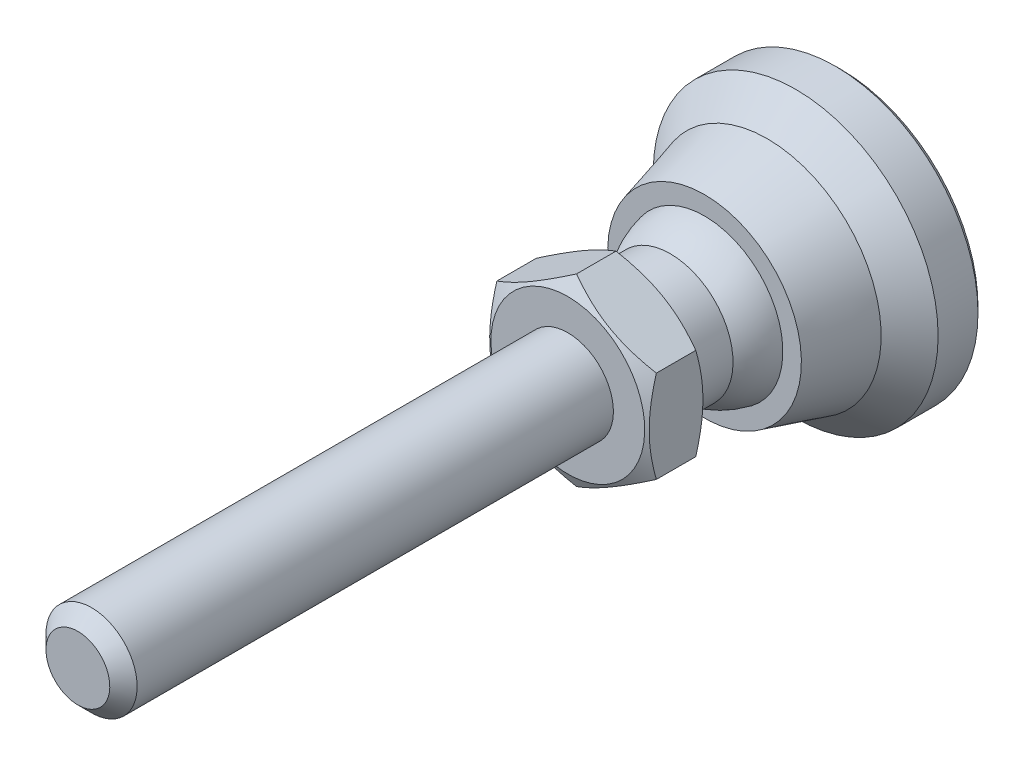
ISO-10303-21;
HEADER;
FILE_DESCRIPTION(('STEP AP214'),'2;1');
FILE_NAME('part.step','',(''),(''),'','','');
FILE_SCHEMA(('AUTOMOTIVE_DESIGN { 1 0 10303 214 1 1 1 1 }'));
ENDSEC;
DATA;
#1=APPLICATION_CONTEXT('core data for automotive mechanical design processes');
#2=APPLICATION_PROTOCOL_DEFINITION('international standard','automotive_design',2000,#1);
#3=PRODUCT_CONTEXT('',#1,'mechanical');
#4=PRODUCT('Part','Part','',(#3));
#5=PRODUCT_RELATED_PRODUCT_CATEGORY('part','',(#4));
#6=PRODUCT_DEFINITION_FORMATION('','',#4);
#7=PRODUCT_DEFINITION_CONTEXT('part definition',#1,'design');
#8=PRODUCT_DEFINITION('design','',#6,#7);
#9=PRODUCT_DEFINITION_SHAPE('','',#8);
#10=(LENGTH_UNIT() NAMED_UNIT(*) SI_UNIT(.MILLI.,.METRE.));
#11=(NAMED_UNIT(*) PLANE_ANGLE_UNIT() SI_UNIT($,.RADIAN.));
#12=(NAMED_UNIT(*) SI_UNIT($,.STERADIAN.) SOLID_ANGLE_UNIT());
#13=UNCERTAINTY_MEASURE_WITH_UNIT(LENGTH_MEASURE(1.E-05),#10,'distance_accuracy_value','');
#14=(GEOMETRIC_REPRESENTATION_CONTEXT(3) GLOBAL_UNCERTAINTY_ASSIGNED_CONTEXT((#13)) GLOBAL_UNIT_ASSIGNED_CONTEXT((#10,
#11,#12)) REPRESENTATION_CONTEXT('',''));
#15=CARTESIAN_POINT('',(0.,0.,0.));
#16=DIRECTION('',(0.,0.,1.));
#17=DIRECTION('',(1.,0.,0.));
#18=AXIS2_PLACEMENT_3D('',#15,#16,#17);
#19=CARTESIAN_POINT('',(-5.49999999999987,0.,19.));
#20=DIRECTION('',(0.,0.,1.));
#21=DIRECTION('',(0.,-1.,0.));
#22=AXIS2_PLACEMENT_3D('',#19,#20,#21);
#23=PLANE('',#22);
#24=CARTESIAN_POINT('',(0.,0.,19.));
#25=DIRECTION('',(0.,0.,-1.));
#26=DIRECTION('',(0.,1.,0.));
#27=AXIS2_PLACEMENT_3D('',#24,#25,#26);
#28=CIRCLE('',#27,5.49999999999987);
#29=CARTESIAN_POINT('',(0.,5.49999999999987,19.));
#30=VERTEX_POINT('',#29);
#31=EDGE_CURVE('E112',#30,#30,#28,.T.);
#32=ORIENTED_EDGE('',*,*,#31,.F.);
#33=EDGE_LOOP('',(#32));
#34=FACE_BOUND('',#33,.T.);
#35=CARTESIAN_POINT('',(0.,0.,19.));
#36=DIRECTION('',(0.,0.,-1.));
#37=DIRECTION('',(0.,1.,0.));
#38=AXIS2_PLACEMENT_3D('',#35,#36,#37);
#39=CIRCLE('',#38,6.75);
#40=CARTESIAN_POINT('',(0.,6.75,19.));
#41=VERTEX_POINT('',#40);
#42=EDGE_CURVE('E73',#41,#41,#39,.T.);
#43=ORIENTED_EDGE('',*,*,#42,.T.);
#44=EDGE_LOOP('',(#43));
#45=FACE_BOUND('',#44,.T.);
#46=ADVANCED_FACE('F14',(#34,#45),#23,.F.);
#47=CARTESIAN_POINT('',(0.,0.,0.5));
#48=DIRECTION('',(0.,0.,1.));
#49=DIRECTION('',(0.,-1.,0.));
#50=AXIS2_PLACEMENT_3D('',#47,#48,#49);
#51=CONICAL_SURFACE('',#50,12.5,0.785398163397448);
#52=CARTESIAN_POINT('',(0.,0.,0.));
#53=DIRECTION('',(0.,0.,-1.));
#54=DIRECTION('',(0.,1.,0.));
#55=AXIS2_PLACEMENT_3D('',#52,#53,#54);
#56=CIRCLE('',#55,12.);
#57=CARTESIAN_POINT('',(0.,12.,0.));
#58=VERTEX_POINT('',#57);
#59=EDGE_CURVE('E9',#58,#58,#56,.T.);
#60=ORIENTED_EDGE('',*,*,#59,.F.);
#61=EDGE_LOOP('',(#60));
#62=FACE_BOUND('',#61,.T.);
#63=CARTESIAN_POINT('',(0.,0.,0.5));
#64=DIRECTION('',(0.,0.,-1.));
#65=DIRECTION('',(0.,1.,0.));
#66=AXIS2_PLACEMENT_3D('',#63,#64,#65);
#67=CIRCLE('',#66,12.5);
#68=CARTESIAN_POINT('',(0.,12.5,0.5));
#69=VERTEX_POINT('',#68);
#70=EDGE_CURVE('E94',#69,#69,#67,.T.);
#71=ORIENTED_EDGE('',*,*,#70,.T.);
#72=EDGE_LOOP('',(#71));
#73=FACE_BOUND('',#72,.T.);
#74=ADVANCED_FACE('F16',(#62,#73),#51,.T.);
#75=CARTESIAN_POINT('',(-12.,0.,0.));
#76=DIRECTION('',(0.,0.,1.));
#77=DIRECTION('',(0.,-1.,0.));
#78=AXIS2_PLACEMENT_3D('',#75,#76,#77);
#79=PLANE('',#78);
#80=ORIENTED_EDGE('',*,*,#59,.T.);
#81=EDGE_LOOP('',(#80));
#82=FACE_BOUND('',#81,.T.);
#83=ADVANCED_FACE('F146',(#82),#79,.F.);
#84=CARTESIAN_POINT('',(0.,0.,0.));
#85=DIRECTION('',(0.,0.,-1.));
#86=DIRECTION('',(0.,1.,0.));
#87=AXIS2_PLACEMENT_3D('',#84,#85,#86);
#88=CYLINDRICAL_SURFACE('',#87,5.49999999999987);
#89=CARTESIAN_POINT('',(0.,0.,15.));
#90=DIRECTION('',(0.,0.,-1.));
#91=DIRECTION('',(0.,1.,0.));
#92=AXIS2_PLACEMENT_3D('',#89,#90,#91);
#93=CIRCLE('',#92,5.49999999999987);
#94=CARTESIAN_POINT('',(-5.49999999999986,0.,15.));
#95=VERTEX_POINT('',#94);
#96=EDGE_CURVE('E109',#95,#95,#93,.T.);
#97=ORIENTED_EDGE('',*,*,#96,.F.);
#98=EDGE_LOOP('',(#97));
#99=FACE_BOUND('',#98,.T.);
#100=ORIENTED_EDGE('',*,*,#31,.T.);
#101=EDGE_LOOP('',(#100));
#102=FACE_BOUND('',#101,.T.);
#103=ADVANCED_FACE('F152',(#99,#102),#88,.T.);
#104=CARTESIAN_POINT('',(1.38777878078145E-13,0.,10.6698729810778));
#105=DIRECTION('',(0.,0.,-1.));
#106=DIRECTION('',(-1.,0.,0.));
#107=AXIS2_PLACEMENT_3D('',#104,#105,#106);
#108=SPHERICAL_SURFACE('',#107,7.);
#109=CARTESIAN_POINT('',(0.,0.,12.));
#110=DIRECTION('',(0.,0.,-1.));
#111=DIRECTION('',(0.,1.,0.));
#112=AXIS2_PLACEMENT_3D('',#109,#110,#111);
#113=CIRCLE('',#112,6.87246404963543);
#114=CARTESIAN_POINT('',(-6.87246404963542,0.,12.));
#115=VERTEX_POINT('',#114);
#116=EDGE_CURVE('E106',#115,#115,#113,.T.);
#117=CARTESIAN_POINT('',(-6.87246404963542,0.,12.));
#118=CARTESIAN_POINT('',(-6.86587210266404,0.,12.0340591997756));
#119=CARTESIAN_POINT('',(-6.85902692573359,0.,12.0680693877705));
#120=CARTESIAN_POINT('',(-6.84483171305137,0.,12.1359842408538));
#121=CARTESIAN_POINT('',(-6.83748167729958,0.,12.1698889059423));
#122=CARTESIAN_POINT('',(-6.8222783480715,0.,12.2375852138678));
#123=CARTESIAN_POINT('',(-6.81442505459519,0.,12.2713768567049));
#124=CARTESIAN_POINT('',(-6.7982169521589,0.,12.3388396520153));
#125=CARTESIAN_POINT('',(-6.78986214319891,0.,12.3725108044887));
#126=CARTESIAN_POINT('',(-6.77265285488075,0.,12.4397251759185));
#127=CARTESIAN_POINT('',(-6.76379837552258,0.,12.473268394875));
#128=CARTESIAN_POINT('',(-6.74559170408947,0.,12.5402194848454));
#129=CARTESIAN_POINT('',(-6.73623951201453,0.,12.5736273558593));
#130=CARTESIAN_POINT('',(-6.71703948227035,0.,12.6403003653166));
#131=CARTESIAN_POINT('',(-6.70719164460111,0.,12.67356550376));
#132=CARTESIAN_POINT('',(-6.68700250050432,0.,12.7399456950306));
#133=CARTESIAN_POINT('',(-6.67666119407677,0.,12.7730607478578));
#134=CARTESIAN_POINT('',(-6.65548739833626,0.,12.8391334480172));
#135=CARTESIAN_POINT('',(-6.64465490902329,0.,12.8720910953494));
#136=CARTESIAN_POINT('',(-6.62250114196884,0.,12.9378416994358));
#137=CARTESIAN_POINT('',(-6.61117986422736,0.,12.9706346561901));
#138=CARTESIAN_POINT('',(-6.58805102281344,0.,13.0360486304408));
#139=CARTESIAN_POINT('',(-6.57624345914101,0.,13.0686696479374));
#140=CARTESIAN_POINT('',(-6.55214465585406,0.,13.1337325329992));
#141=CARTESIAN_POINT('',(-6.53985341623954,0.,13.1661744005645));
#142=CARTESIAN_POINT('',(-6.51478997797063,0.,13.2308718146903));
#143=CARTESIAN_POINT('',(-6.50201777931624,0.,13.2631273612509));
#144=CARTESIAN_POINT('',(-6.47599524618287,0.,13.3274450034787));
#145=CARTESIAN_POINT('',(-6.46274491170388,0.,13.3595070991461));
#146=CARTESIAN_POINT('',(-6.43576903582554,0.,13.4234307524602));
#147=CARTESIAN_POINT('',(-6.42204349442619,0.,13.455292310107));
#148=CARTESIAN_POINT('',(-6.39412023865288,0.,13.5188078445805));
#149=CARTESIAN_POINT('',(-6.37992252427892,0.,13.5504618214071));
#150=CARTESIAN_POINT('',(-6.35105806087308,0.,13.6135551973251));
#151=CARTESIAN_POINT('',(-6.33639131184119,0.,13.6449945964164));
#152=CARTESIAN_POINT('',(-6.30659202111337,0.,13.7076518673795));
#153=CARTESIAN_POINT('',(-6.29145947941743,0.,13.7388697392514));
#154=CARTESIAN_POINT('',(-6.26073194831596,0.,13.8010770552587));
#155=CARTESIAN_POINT('',(-6.24513695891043,0.,13.8320664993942));
#156=CARTESIAN_POINT('',(-6.21348797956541,0.,13.8938101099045));
#157=CARTESIAN_POINT('',(-6.19743398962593,0.,13.9245642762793));
#158=CARTESIAN_POINT('',(-6.16487055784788,0.,13.9858305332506));
#159=CARTESIAN_POINT('',(-6.14836111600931,0.,14.016342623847));
#160=CARTESIAN_POINT('',(-6.11489042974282,0.,14.0771179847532));
#161=CARTESIAN_POINT('',(-6.09792918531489,0.,14.107381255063));
#162=CARTESIAN_POINT('',(-6.06355864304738,0.,14.1676522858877));
#163=CARTESIAN_POINT('',(-6.04614934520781,0.,14.1976600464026));
#164=CARTESIAN_POINT('',(-6.01088654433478,0.,14.2574134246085));
#165=CARTESIAN_POINT('',(-5.99303304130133,0.,14.2871590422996));
#166=CARTESIAN_POINT('',(-5.95688577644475,0.,14.3463815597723));
#167=CARTESIAN_POINT('',(-5.93859201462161,0.,14.3758584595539));
#168=CARTESIAN_POINT('',(-5.90156827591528,0.,14.4345370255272));
#169=CARTESIAN_POINT('',(-5.88283829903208,0.,14.4637386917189));
#170=CARTESIAN_POINT('',(-5.84494627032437,0.,14.5218603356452));
#171=CARTESIAN_POINT('',(-5.82578421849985,0.,14.5507803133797));
#172=CARTESIAN_POINT('',(-5.78703227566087,0.,14.6083321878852));
#173=CARTESIAN_POINT('',(-5.76744238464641,0.,14.6369640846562));
#174=CARTESIAN_POINT('',(-5.72783909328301,0.,14.6939334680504));
#175=CARTESIAN_POINT('',(-5.70782569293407,0.,14.7222709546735));
#176=CARTESIAN_POINT('',(-5.66737980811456,0.,14.778645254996));
#177=CARTESIAN_POINT('',(-5.646947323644,0.,14.8066820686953));
#178=CARTESIAN_POINT('',(-5.60566778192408,0.,14.862448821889));
#179=CARTESIAN_POINT('',(-5.58482072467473,0.,14.8901787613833));
#180=CARTESIAN_POINT('',(-5.54271666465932,0.,14.9453256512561));
#181=CARTESIAN_POINT('',(-5.52145966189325,0.,14.9727426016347));
#182=CARTESIAN_POINT('',(-5.49999999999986,0.,15.));
#183=B_SPLINE_CURVE_WITH_KNOTS('',3,(#117,#118,#119,#120,#121,#122,#123,#124,#125,#126,#127,
#128,#129,#130,#131,#132,#133,#134,#135,#136,#137,#138,#139,#140,#141,#142,#143,#144,#145,#146,
#147,#148,#149,#150,#151,#152,#153,#154,#155,#156,#157,#158,#159,#160,#161,#162,#163,#164,#165,
#166,#167,#168,#169,#170,#171,#172,#173,#174,#175,#176,#177,#178,#179,#180,#181,#182),
.UNSPECIFIED.,.F.,.F.,(4,2,2,2,2,2,2,2,2,2,2,2,2,2,2,2,2,2,2,2,2,2,2,2,2,2,2,2,2,2,2,2,4),(0.,
0.104072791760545,0.208145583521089,0.312218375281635,0.416291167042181,0.520363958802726,
0.62443675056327,0.728509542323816,0.83258233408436,0.936655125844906,1.04072791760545,
1.144800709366,1.24887350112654,1.35294629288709,1.45701908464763,1.56109187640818,
1.66516466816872,1.76923745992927,1.87331025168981,1.97738304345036,2.0814558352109,
2.18552862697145,2.28960141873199,2.39367421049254,2.49774700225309,2.60181979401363,
2.70589258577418,2.80996537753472,2.91403816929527,3.01811096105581,3.12218375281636,
3.2262565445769,3.33032933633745),.UNSPECIFIED.);
#184=EDGE_CURVE('BSEAM248',#115,#95,#183,.T.);
#185=ORIENTED_EDGE('',*,*,#116,.F.);
#186=ORIENTED_EDGE('',*,*,#96,.T.);
#187=ORIENTED_EDGE('',*,*,#184,.T.);
#188=ORIENTED_EDGE('',*,*,#184,.F.);
#189=EDGE_LOOP('',(#185,#187,#186,#188));
#190=FACE_BOUND('',#189,.T.);
#191=ADVANCED_FACE('F248',(#190),#108,.T.);
#192=CARTESIAN_POINT('',(-8.5,0.,12.));
#193=DIRECTION('',(0.,0.,-1.));
#194=DIRECTION('',(0.,1.,0.));
#195=AXIS2_PLACEMENT_3D('',#192,#193,#194);
#196=PLANE('',#195);
#197=CARTESIAN_POINT('',(0.,0.,12.));
#198=DIRECTION('',(0.,0.,-1.));
#199=DIRECTION('',(0.,1.,0.));
#200=AXIS2_PLACEMENT_3D('',#197,#198,#199);
#201=CIRCLE('',#200,8.5);
#202=CARTESIAN_POINT('',(0.,8.5,12.));
#203=VERTEX_POINT('',#202);
#204=EDGE_CURVE('E103',#203,#203,#201,.T.);
#205=ORIENTED_EDGE('',*,*,#204,.F.);
#206=EDGE_LOOP('',(#205));
#207=FACE_BOUND('',#206,.T.);
#208=ORIENTED_EDGE('',*,*,#116,.T.);
#209=EDGE_LOOP('',(#208));
#210=FACE_BOUND('',#209,.T.);
#211=ADVANCED_FACE('F245',(#207,#210),#196,.F.);
#212=CARTESIAN_POINT('',(0.,0.,12.));
#213=DIRECTION('',(0.,0.,-1.));
#214=DIRECTION('',(0.,1.,0.));
#215=AXIS2_PLACEMENT_3D('',#212,#213,#214);
#216=CONICAL_SURFACE('',#215,8.5,0.266252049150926);
#217=CARTESIAN_POINT('',(0.,0.,6.5));
#218=DIRECTION('',(0.,0.,-1.));
#219=DIRECTION('',(0.,1.,0.));
#220=AXIS2_PLACEMENT_3D('',#217,#218,#219);
#221=CIRCLE('',#220,10.);
#222=CARTESIAN_POINT('',(0.,10.,6.5));
#223=VERTEX_POINT('',#222);
#224=EDGE_CURVE('E100',#223,#223,#221,.T.);
#225=ORIENTED_EDGE('',*,*,#224,.F.);
#226=EDGE_LOOP('',(#225));
#227=FACE_BOUND('',#226,.T.);
#228=ORIENTED_EDGE('',*,*,#204,.T.);
#229=EDGE_LOOP('',(#228));
#230=FACE_BOUND('',#229,.T.);
#231=ADVANCED_FACE('F241',(#227,#230),#216,.T.);
#232=CARTESIAN_POINT('',(0.,0.,6.5));
#233=DIRECTION('',(0.,0.,-1.));
#234=DIRECTION('',(0.,1.,0.));
#235=AXIS2_PLACEMENT_3D('',#232,#233,#234);
#236=CONICAL_SURFACE('',#235,10.,0.785398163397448);
#237=CARTESIAN_POINT('',(0.,0.,4.));
#238=DIRECTION('',(0.,0.,-1.));
#239=DIRECTION('',(0.,1.,0.));
#240=AXIS2_PLACEMENT_3D('',#237,#238,#239);
#241=CIRCLE('',#240,12.5);
#242=CARTESIAN_POINT('',(0.,12.5,4.));
#243=VERTEX_POINT('',#242);
#244=EDGE_CURVE('E97',#243,#243,#241,.T.);
#245=ORIENTED_EDGE('',*,*,#244,.F.);
#246=EDGE_LOOP('',(#245));
#247=FACE_BOUND('',#246,.T.);
#248=ORIENTED_EDGE('',*,*,#224,.T.);
#249=EDGE_LOOP('',(#248));
#250=FACE_BOUND('',#249,.T.);
#251=ADVANCED_FACE('F237',(#247,#250),#236,.T.);
#252=CARTESIAN_POINT('',(0.,0.,0.));
#253=DIRECTION('',(0.,0.,-1.));
#254=DIRECTION('',(0.,1.,0.));
#255=AXIS2_PLACEMENT_3D('',#252,#253,#254);
#256=CYLINDRICAL_SURFACE('',#255,12.5);
#257=ORIENTED_EDGE('',*,*,#70,.F.);
#258=EDGE_LOOP('',(#257));
#259=FACE_BOUND('',#258,.T.);
#260=ORIENTED_EDGE('',*,*,#244,.T.);
#261=EDGE_LOOP('',(#260));
#262=FACE_BOUND('',#261,.T.);
#263=ADVANCED_FACE('F137',(#259,#262),#256,.T.);
#264=CARTESIAN_POINT('',(0.,0.,19.));
#265=DIRECTION('',(0.,0.,1.));
#266=DIRECTION('',(0.,-1.,0.));
#267=AXIS2_PLACEMENT_3D('',#264,#265,#266);
#268=CONICAL_SURFACE('',#267,6.75,1.0471975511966);
#269=CARTESIAN_POINT('',(-7.,10.8907699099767,22.5774842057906));
#270=CARTESIAN_POINT('',(-7.,10.5847384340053,22.4288913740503));
#271=CARTESIAN_POINT('',(-7.,10.27800818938,22.2817132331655));
#272=CARTESIAN_POINT('',(-7.,9.66277868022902,21.9909812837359));
#273=CARTESIAN_POINT('',(-7.,9.3542791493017,21.8474280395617));
#274=CARTESIAN_POINT('',(-7.,8.73356682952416,21.5640260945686));
#275=CARTESIAN_POINT('',(-7.,8.42134299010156,21.4242015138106));
#276=CARTESIAN_POINT('',(-7.,7.79442424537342,21.150227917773));
#277=CARTESIAN_POINT('',(-7.,7.47972945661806,21.0160786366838));
#278=CARTESIAN_POINT('',(-7.,6.83707768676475,20.7507035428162));
#279=CARTESIAN_POINT('',(-7.,6.50902228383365,20.6197147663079));
#280=CARTESIAN_POINT('',(-7.,5.84908717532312,20.3675665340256));
#281=CARTESIAN_POINT('',(-7.,5.51720704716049,20.2464081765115));
#282=CARTESIAN_POINT('',(-7.,4.84970041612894,20.0170761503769));
#283=CARTESIAN_POINT('',(-7.,4.51408293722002,19.9088764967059));
#284=CARTESIAN_POINT('',(-7.,3.83804566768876,19.7089093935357));
#285=CARTESIAN_POINT('',(-7.,3.49762741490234,19.6171368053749));
#286=CARTESIAN_POINT('',(-7.,2.81363495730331,19.454900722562));
#287=CARTESIAN_POINT('',(-7.,2.47008922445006,19.3843204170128));
#288=CARTESIAN_POINT('',(-7.,1.95161396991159,19.2973818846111));
#289=CARTESIAN_POINT('',(-7.,1.77825011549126,19.2715565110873));
#290=CARTESIAN_POINT('',(-7.,1.43064965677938,19.2267222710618));
#291=CARTESIAN_POINT('',(-7.,1.25641314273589,19.2077127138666));
#292=CARTESIAN_POINT('',(-7.,0.909591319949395,19.1771288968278));
#293=CARTESIAN_POINT('',(-7.,0.737014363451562,19.1654603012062));
#294=CARTESIAN_POINT('',(-7.,0.391521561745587,19.1494333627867));
#295=CARTESIAN_POINT('',(-7.,0.218605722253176,19.1450748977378));
#296=CARTESIAN_POINT('',(-7.,-0.127255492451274,19.1437723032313));
#297=CARTESIAN_POINT('',(-7.,-0.300200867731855,19.1468281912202));
#298=CARTESIAN_POINT('',(-7.,-0.64580812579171,19.1602791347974));
#299=CARTESIAN_POINT('',(-7.,-0.818469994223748,19.1706745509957));
#300=CARTESIAN_POINT('',(-7.,-1.23236793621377,19.2041702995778));
#301=CARTESIAN_POINT('',(-7.,-1.47333290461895,19.2306940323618));
#302=CARTESIAN_POINT('',(-7.,-1.95348602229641,19.2965973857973));
#303=CARTESIAN_POINT('',(-7.,-2.19267392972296,19.3359787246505));
#304=CARTESIAN_POINT('',(-7.,-2.90729182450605,19.4713219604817));
#305=CARTESIAN_POINT('',(-7.,-3.37951267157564,19.5844589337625));
#306=CARTESIAN_POINT('',(-7.,-4.08566220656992,19.7808040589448));
#307=CARTESIAN_POINT('',(-7.,-4.32324940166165,19.8516126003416));
#308=CARTESIAN_POINT('',(-7.,-4.79611652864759,20.0006233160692));
#309=CARTESIAN_POINT('',(-7.,-5.03139644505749,20.0788255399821));
#310=CARTESIAN_POINT('',(-7.,-5.49972232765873,20.2413656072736));
#311=CARTESIAN_POINT('',(-7.,-5.73276899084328,20.3257014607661));
#312=CARTESIAN_POINT('',(-7.,-6.19692870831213,20.4995125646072));
#313=CARTESIAN_POINT('',(-7.,-6.42804178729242,20.5889877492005));
#314=CARTESIAN_POINT('',(-7.,-6.98148828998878,20.8092053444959));
#315=CARTESIAN_POINT('',(-7.,-7.30299231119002,20.9420285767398));
#316=CARTESIAN_POINT('',(-7.,-7.94319832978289,21.2142843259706));
#317=CARTESIAN_POINT('',(-7.,-8.26190014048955,21.3537172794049));
#318=CARTESIAN_POINT('',(-7.,-8.89703676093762,21.6378419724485));
#319=CARTESIAN_POINT('',(-7.,-9.21347100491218,21.7825349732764));
#320=CARTESIAN_POINT('',(-7.,-9.84438261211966,22.0760967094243));
#321=CARTESIAN_POINT('',(-7.,-10.1588600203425,22.224965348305));
#322=CARTESIAN_POINT('',(-7.,-10.7865516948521,22.5262551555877));
#323=CARTESIAN_POINT('',(-7.,-11.0997640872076,22.6786802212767));
#324=CARTESIAN_POINT('',(-7.,-11.7248247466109,22.9863047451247));
#325=CARTESIAN_POINT('',(-7.,-12.0366730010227,23.1415042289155));
#326=CARTESIAN_POINT('',(-7.,-12.9704143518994,23.6104689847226));
#327=CARTESIAN_POINT('',(-7.,-13.5905944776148,23.9276443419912));
#328=CARTESIAN_POINT('',(-7.,-14.7742522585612,24.5406925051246));
#329=CARTESIAN_POINT('',(-7.,-15.3380029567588,24.8360405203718));
#330=CARTESIAN_POINT('',(-7.,-16.4634220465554,25.4307264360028));
#331=CARTESIAN_POINT('',(-7.,-17.025090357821,25.7300644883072));
#332=CARTESIAN_POINT('',(-7.,-18.1453428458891,26.3309836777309));
#333=CARTESIAN_POINT('',(-7.,-18.7039312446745,26.632556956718));
#334=CARTESIAN_POINT('',(-7.,-19.8197815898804,27.2380719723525));
#335=CARTESIAN_POINT('',(-7.,-20.3770436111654,27.5420135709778));
#336=CARTESIAN_POINT('',(-7.,-20.9338200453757,27.8468361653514));
#337=B_SPLINE_CURVE_WITH_KNOTS('',3,(#269,#270,#271,#272,#273,#274,#275,#276,#277,#278,#279,
#280,#281,#282,#283,#284,#285,#286,#287,#288,#289,#290,#291,#292,#293,#294,#295,#296,#297,#298,
#299,#300,#301,#302,#303,#304,#305,#306,#307,#308,#309,#310,#311,#312,#313,#314,#315,#316,#317,
#318,#319,#320,#321,#322,#323,#324,#325,#326,#327,#328,#329,#330,#331,#332,#333,#334,#335,#336),
.UNSPECIFIED.,.F.,.F.,(4,2,2,2,2,2,2,2,2,2,2,2,2,2,2,2,2,2,2,2,2,2,2,2,2,2,2,2,2,2,2,2,2,4),(0.,
1.02060811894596,2.04137417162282,3.06763866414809,4.09385503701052,5.15345237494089,
6.21316792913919,7.2707216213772,8.32794391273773,9.37922709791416,9.90494478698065,
10.4306091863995,10.949372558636,11.4681272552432,11.9868831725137,12.5056645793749,
13.2325156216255,13.9594638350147,15.4141499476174,16.1578302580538,16.9015155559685,
17.6449606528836,18.3883962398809,19.4318765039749,20.4754257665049,21.5192269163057,
22.5630039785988,23.6079842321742,24.6529741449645,26.7426525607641,28.651930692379,
30.5612817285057,32.4656671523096,34.3699424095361),.UNSPECIFIED.);
#338=CARTESIAN_POINT('',(-7.,4.04145188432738,19.7695523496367));
#339=VERTEX_POINT('',#338);
#340=CARTESIAN_POINT('',(-7.,-4.04145188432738,19.7695523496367));
#341=VERTEX_POINT('',#340);
#342=EDGE_CURVE('E79',#339,#341,#337,.T.);
#343=ORIENTED_EDGE('',*,*,#342,.F.);
#344=CARTESIAN_POINT('',(0.000199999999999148,8.0830192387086,19.7696190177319));
#345=CARTESIAN_POINT('',(-0.153667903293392,7.99418356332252,19.7183374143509));
#346=CARTESIAN_POINT('',(-0.308109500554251,7.90501666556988,19.669383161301));
#347=CARTESIAN_POINT('',(-0.618246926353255,7.72595873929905,19.5767703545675));
#348=CARTESIAN_POINT('',(-0.773943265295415,7.63606741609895,19.5331140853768));
#349=CARTESIAN_POINT('',(-1.24352516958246,7.36495417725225,19.4109491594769));
#350=CARTESIAN_POINT('',(-1.5592643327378,7.18266208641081,19.3414631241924));
#351=CARTESIAN_POINT('',(-2.03176224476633,6.9098652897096,19.2599825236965));
#352=CARTESIAN_POINT('',(-2.18710922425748,6.82017566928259,19.2367710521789));
#353=CARTESIAN_POINT('',(-2.49850511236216,6.64039116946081,19.1978487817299));
#354=CARTESIAN_POINT('',(-2.6545539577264,6.55029632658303,19.1821373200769));
#355=CARTESIAN_POINT('',(-2.96692267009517,6.36995016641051,19.1586154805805));
#356=CARTESIAN_POINT('',(-3.12324202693,6.27969914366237,19.1507961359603));
#357=CARTESIAN_POINT('',(-3.43601650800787,6.09911871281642,19.1432178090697));
#358=CARTESIAN_POINT('',(-3.59247162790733,6.00878930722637,19.1434585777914));
#359=CARTESIAN_POINT('',(-4.02110687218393,5.76131663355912,19.155197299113));
#360=CARTESIAN_POINT('',(-4.2931466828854,5.60425437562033,19.1749033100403));
#361=CARTESIAN_POINT('',(-4.83541944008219,5.29117305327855,19.2373910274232));
#362=CARTESIAN_POINT('',(-5.10565047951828,5.13515508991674,19.2801940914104));
#363=CARTESIAN_POINT('',(-5.64901454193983,4.82144370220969,19.3871892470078));
#364=CARTESIAN_POINT('',(-5.92207900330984,4.66378986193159,19.4518346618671));
#365=CARTESIAN_POINT('',(-6.46413578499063,4.35083323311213,19.5985536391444));
#366=CARTESIAN_POINT('',(-6.73313504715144,4.19552643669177,19.680592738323));
#367=CARTESIAN_POINT('',(-7.0002,4.04133641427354,19.7696190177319));
#368=B_SPLINE_CURVE_WITH_KNOTS('',3,(#344,#345,#346,#347,#348,#349,#350,#351,#352,#353,#354,
#355,#356,#357,#358,#359,#360,#361,#362,#363,#364,#365,#366,#367),.UNSPECIFIED.,.F.,.F.,(4,2,2,
2,2,2,2,2,2,2,2,4),(0.,0.554727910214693,1.10969417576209,2.2219327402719,2.76443041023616,
3.30688013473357,3.84871284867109,4.39052882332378,5.33376515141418,6.27787517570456,
7.2429241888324,8.20607866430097),.UNSPECIFIED.);
#369=CARTESIAN_POINT('',(0.,8.08290376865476,19.7695523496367));
#370=VERTEX_POINT('',#369);
#371=EDGE_CURVE('E426',#370,#339,#368,.T.);
#372=ORIENTED_EDGE('',*,*,#371,.F.);
#373=CARTESIAN_POINT('',(7.0002,4.04133641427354,19.7696190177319));
#374=CARTESIAN_POINT('',(6.84633209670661,4.13017208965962,19.7183374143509));
#375=CARTESIAN_POINT('',(6.69189049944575,4.21933898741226,19.669383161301));
#376=CARTESIAN_POINT('',(6.38175307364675,4.39839691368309,19.5767703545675));
#377=CARTESIAN_POINT('',(6.22605673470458,4.48828823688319,19.5331140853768));
#378=CARTESIAN_POINT('',(5.75647483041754,4.75940147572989,19.4109491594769));
#379=CARTESIAN_POINT('',(5.4407356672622,4.94169356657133,19.3414631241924));
#380=CARTESIAN_POINT('',(4.96823775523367,5.21449036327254,19.2599825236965));
#381=CARTESIAN_POINT('',(4.81289077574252,5.30417998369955,19.2367710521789));
#382=CARTESIAN_POINT('',(4.50149488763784,5.48396448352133,19.1978487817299));
#383=CARTESIAN_POINT('',(4.34544604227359,5.57405932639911,19.1821373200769));
#384=CARTESIAN_POINT('',(4.03307732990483,5.75440548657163,19.1586154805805));
#385=CARTESIAN_POINT('',(3.87675797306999,5.84465650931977,19.1507961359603));
#386=CARTESIAN_POINT('',(3.56398349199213,6.02523694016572,19.1432178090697));
#387=CARTESIAN_POINT('',(3.40752837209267,6.11556634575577,19.1434585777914));
#388=CARTESIAN_POINT('',(2.97889312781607,6.36303901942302,19.155197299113));
#389=CARTESIAN_POINT('',(2.7068533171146,6.52010127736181,19.1749033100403));
#390=CARTESIAN_POINT('',(2.16458055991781,6.83318259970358,19.2373910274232));
#391=CARTESIAN_POINT('',(1.89434952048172,6.9892005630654,19.2801940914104));
#392=CARTESIAN_POINT('',(1.35098545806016,7.30291195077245,19.3871892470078));
#393=CARTESIAN_POINT('',(1.07792099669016,7.46056579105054,19.4518346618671));
#394=CARTESIAN_POINT('',(0.535864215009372,7.77352241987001,19.5985536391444));
#395=CARTESIAN_POINT('',(0.266864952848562,7.92882921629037,19.680592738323));
#396=CARTESIAN_POINT('',(-0.000200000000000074,8.0830192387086,19.7696190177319));
#397=B_SPLINE_CURVE_WITH_KNOTS('',3,(#373,#374,#375,#376,#377,#378,#379,#380,#381,#382,#383,
#384,#385,#386,#387,#388,#389,#390,#391,#392,#393,#394,#395,#396),.UNSPECIFIED.,.F.,.F.,(4,2,2,
2,2,2,2,2,2,2,2,4),(0.,0.554727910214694,1.10969417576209,2.2219327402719,2.76443041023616,
3.30688013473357,3.84871284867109,4.39052882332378,5.33376515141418,6.27787517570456,
7.2429241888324,8.20607866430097),.UNSPECIFIED.);
#398=CARTESIAN_POINT('',(7.,4.04145188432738,19.7695523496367));
#399=VERTEX_POINT('',#398);
#400=EDGE_CURVE('E414',#399,#370,#397,.T.);
#401=ORIENTED_EDGE('',*,*,#400,.F.);
#402=CARTESIAN_POINT('',(7.,10.8907699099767,22.5774842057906));
#403=CARTESIAN_POINT('',(7.,10.5847384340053,22.4288913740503));
#404=CARTESIAN_POINT('',(7.,10.27800818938,22.2817132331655));
#405=CARTESIAN_POINT('',(7.,9.66277868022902,21.9909812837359));
#406=CARTESIAN_POINT('',(7.,9.35427914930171,21.8474280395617));
#407=CARTESIAN_POINT('',(7.,8.73356682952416,21.5640260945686));
#408=CARTESIAN_POINT('',(7.,8.42134299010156,21.4242015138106));
#409=CARTESIAN_POINT('',(7.,7.79442424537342,21.150227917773));
#410=CARTESIAN_POINT('',(7.,7.47972945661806,21.0160786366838));
#411=CARTESIAN_POINT('',(7.,6.83707768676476,20.7507035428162));
#412=CARTESIAN_POINT('',(7.,6.50902228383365,20.6197147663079));
#413=CARTESIAN_POINT('',(7.,5.84908717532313,20.3675665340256));
#414=CARTESIAN_POINT('',(7.,5.51720704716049,20.2464081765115));
#415=CARTESIAN_POINT('',(7.,4.84970041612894,20.0170761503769));
#416=CARTESIAN_POINT('',(7.,4.51408293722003,19.9088764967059));
#417=CARTESIAN_POINT('',(7.,3.83804566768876,19.7089093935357));
#418=CARTESIAN_POINT('',(7.,3.49762741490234,19.6171368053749));
#419=CARTESIAN_POINT('',(7.,2.81363495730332,19.454900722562));
#420=CARTESIAN_POINT('',(7.,2.47008922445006,19.3843204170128));
#421=CARTESIAN_POINT('',(7.,1.95161396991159,19.2973818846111));
#422=CARTESIAN_POINT('',(7.,1.77825011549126,19.2715565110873));
#423=CARTESIAN_POINT('',(7.,1.43064965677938,19.2267222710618));
#424=CARTESIAN_POINT('',(7.,1.2564131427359,19.2077127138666));
#425=CARTESIAN_POINT('',(7.,0.909591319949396,19.1771288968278));
#426=CARTESIAN_POINT('',(7.,0.737014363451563,19.1654603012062));
#427=CARTESIAN_POINT('',(7.,0.391521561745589,19.1494333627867));
#428=CARTESIAN_POINT('',(7.,0.218605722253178,19.1450748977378));
#429=CARTESIAN_POINT('',(7.,-0.127255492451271,19.1437723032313));
#430=CARTESIAN_POINT('',(7.,-0.300200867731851,19.1468281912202));
#431=CARTESIAN_POINT('',(7.,-0.645808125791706,19.1602791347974));
#432=CARTESIAN_POINT('',(7.,-0.818469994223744,19.1706745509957));
#433=CARTESIAN_POINT('',(7.,-1.23236793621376,19.2041702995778));
#434=CARTESIAN_POINT('',(7.,-1.47333290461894,19.2306940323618));
#435=CARTESIAN_POINT('',(7.,-1.95348602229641,19.2965973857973));
#436=CARTESIAN_POINT('',(7.,-2.19267392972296,19.3359787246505));
#437=CARTESIAN_POINT('',(7.,-2.90729182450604,19.4713219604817));
#438=CARTESIAN_POINT('',(7.,-3.37951267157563,19.5844589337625));
#439=CARTESIAN_POINT('',(7.,-4.08566220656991,19.7808040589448));
#440=CARTESIAN_POINT('',(7.,-4.32324940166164,19.8516126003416));
#441=CARTESIAN_POINT('',(7.,-4.79611652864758,20.0006233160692));
#442=CARTESIAN_POINT('',(7.,-5.03139644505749,20.0788255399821));
#443=CARTESIAN_POINT('',(7.,-5.49972232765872,20.2413656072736));
#444=CARTESIAN_POINT('',(7.,-5.73276899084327,20.3257014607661));
#445=CARTESIAN_POINT('',(7.,-6.19692870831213,20.4995125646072));
#446=CARTESIAN_POINT('',(7.,-6.42804178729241,20.5889877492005));
#447=CARTESIAN_POINT('',(7.,-6.98148828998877,20.8092053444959));
#448=CARTESIAN_POINT('',(7.,-7.30299231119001,20.9420285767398));
#449=CARTESIAN_POINT('',(7.,-7.94319832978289,21.2142843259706));
#450=CARTESIAN_POINT('',(7.,-8.26190014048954,21.3537172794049));
#451=CARTESIAN_POINT('',(7.,-8.89703676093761,21.6378419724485));
#452=CARTESIAN_POINT('',(7.,-9.21347100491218,21.7825349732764));
#453=CARTESIAN_POINT('',(7.,-9.84438261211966,22.0760967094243));
#454=CARTESIAN_POINT('',(7.,-10.1588600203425,22.224965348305));
#455=CARTESIAN_POINT('',(7.,-10.7865516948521,22.5262551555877));
#456=CARTESIAN_POINT('',(7.,-11.0997640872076,22.6786802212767));
#457=CARTESIAN_POINT('',(7.,-11.7248247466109,22.9863047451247));
#458=CARTESIAN_POINT('',(7.,-12.0366730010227,23.1415042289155));
#459=CARTESIAN_POINT('',(7.,-12.9704143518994,23.6104689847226));
#460=CARTESIAN_POINT('',(7.,-13.5905944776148,23.9276443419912));
#461=CARTESIAN_POINT('',(7.,-14.7742522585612,24.5406925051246));
#462=CARTESIAN_POINT('',(7.,-15.3380029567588,24.8360405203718));
#463=CARTESIAN_POINT('',(7.,-16.4634220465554,25.4307264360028));
#464=CARTESIAN_POINT('',(7.,-17.025090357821,25.7300644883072));
#465=CARTESIAN_POINT('',(7.,-18.1453428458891,26.3309836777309));
#466=CARTESIAN_POINT('',(7.,-18.7039312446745,26.632556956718));
#467=CARTESIAN_POINT('',(7.,-19.8197815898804,27.2380719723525));
#468=CARTESIAN_POINT('',(7.,-20.3770436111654,27.5420135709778));
#469=CARTESIAN_POINT('',(7.,-20.9338200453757,27.8468361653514));
#470=B_SPLINE_CURVE_WITH_KNOTS('',3,(#402,#403,#404,#405,#406,#407,#408,#409,#410,#411,#412,
#413,#414,#415,#416,#417,#418,#419,#420,#421,#422,#423,#424,#425,#426,#427,#428,#429,#430,#431,
#432,#433,#434,#435,#436,#437,#438,#439,#440,#441,#442,#443,#444,#445,#446,#447,#448,#449,#450,
#451,#452,#453,#454,#455,#456,#457,#458,#459,#460,#461,#462,#463,#464,#465,#466,#467,#468,#469),
.UNSPECIFIED.,.F.,.F.,(4,2,2,2,2,2,2,2,2,2,2,2,2,2,2,2,2,2,2,2,2,2,2,2,2,2,2,2,2,2,2,2,2,4),(0.,
1.02060811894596,2.04137417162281,3.06763866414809,4.09385503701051,5.15345237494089,
6.21316792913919,7.2707216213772,8.32794391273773,9.37922709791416,9.90494478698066,
10.4306091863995,10.949372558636,11.4681272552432,11.9868831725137,12.5056645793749,
13.2325156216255,13.9594638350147,15.4141499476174,16.1578302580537,16.9015155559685,
17.6449606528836,18.3883962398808,19.4318765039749,20.4754257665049,21.5192269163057,
22.5630039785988,23.6079842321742,24.6529741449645,26.7426525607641,28.651930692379,
30.5612817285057,32.4656671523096,34.3699424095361),.UNSPECIFIED.);
#471=CARTESIAN_POINT('',(7.,-4.04145188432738,19.7695523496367));
#472=VERTEX_POINT('',#471);
#473=EDGE_CURVE('E29',#472,#399,#470,.F.);
#474=ORIENTED_EDGE('',*,*,#473,.F.);
#475=CARTESIAN_POINT('',(-0.000199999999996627,-8.08301923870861,19.7696190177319));
#476=CARTESIAN_POINT('',(0.153667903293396,-7.99418356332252,19.7183374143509));
#477=CARTESIAN_POINT('',(0.308109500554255,-7.90501666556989,19.669383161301));
#478=CARTESIAN_POINT('',(0.618246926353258,-7.72595873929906,19.5767703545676));
#479=CARTESIAN_POINT('',(0.773943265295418,-7.63606741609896,19.5331140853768));
#480=CARTESIAN_POINT('',(1.24352516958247,-7.36495417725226,19.4109491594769));
#481=CARTESIAN_POINT('',(1.5592643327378,-7.18266208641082,19.3414631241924));
#482=CARTESIAN_POINT('',(2.03176224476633,-6.90986528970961,19.2599825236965));
#483=CARTESIAN_POINT('',(2.18710922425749,-6.8201756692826,19.2367710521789));
#484=CARTESIAN_POINT('',(2.49850511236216,-6.64039116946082,19.1978487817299));
#485=CARTESIAN_POINT('',(2.65455395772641,-6.55029632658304,19.1821373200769));
#486=CARTESIAN_POINT('',(2.96692267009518,-6.36995016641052,19.1586154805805));
#487=CARTESIAN_POINT('',(3.12324202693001,-6.27969914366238,19.1507961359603));
#488=CARTESIAN_POINT('',(3.43601650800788,-6.09911871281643,19.1432178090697));
#489=CARTESIAN_POINT('',(3.59247162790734,-6.00878930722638,19.1434585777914));
#490=CARTESIAN_POINT('',(4.02110687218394,-5.76131663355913,19.155197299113));
#491=CARTESIAN_POINT('',(4.2931466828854,-5.60425437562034,19.1749033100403));
#492=CARTESIAN_POINT('',(4.8354194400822,-5.29117305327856,19.2373910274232));
#493=CARTESIAN_POINT('',(5.10565047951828,-5.13515508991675,19.2801940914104));
#494=CARTESIAN_POINT('',(5.64901454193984,-4.8214437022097,19.3871892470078));
#495=CARTESIAN_POINT('',(5.92207900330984,-4.66378986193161,19.4518346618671));
#496=CARTESIAN_POINT('',(6.46413578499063,-4.35083323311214,19.5985536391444));
#497=CARTESIAN_POINT('',(6.73313504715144,-4.19552643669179,19.680592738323));
#498=CARTESIAN_POINT('',(7.0002,-4.04133641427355,19.7696190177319));
#499=B_SPLINE_CURVE_WITH_KNOTS('',3,(#475,#476,#477,#478,#479,#480,#481,#482,#483,#484,#485,
#486,#487,#488,#489,#490,#491,#492,#493,#494,#495,#496,#497,#498),.UNSPECIFIED.,.F.,.F.,(4,2,2,
2,2,2,2,2,2,2,2,4),(0.,0.554727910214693,1.10969417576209,2.2219327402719,2.76443041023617,
3.30688013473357,3.8487128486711,4.39052882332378,5.33376515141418,6.27787517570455,
7.24292418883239,8.20607866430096),.UNSPECIFIED.);
#500=CARTESIAN_POINT('',(0.,-8.08290376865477,19.7695523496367));
#501=VERTEX_POINT('',#500);
#502=EDGE_CURVE('E66',#501,#472,#499,.T.);
#503=ORIENTED_EDGE('',*,*,#502,.F.);
#504=CARTESIAN_POINT('',(-7.0002,-4.04133641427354,19.7696190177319));
#505=CARTESIAN_POINT('',(-6.84633209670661,-4.13017208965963,19.7183374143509));
#506=CARTESIAN_POINT('',(-6.69189049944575,-4.21933898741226,19.669383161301));
#507=CARTESIAN_POINT('',(-6.38175307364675,-4.3983969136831,19.5767703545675));
#508=CARTESIAN_POINT('',(-6.22605673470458,-4.48828823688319,19.5331140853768));
#509=CARTESIAN_POINT('',(-5.75647483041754,-4.7594014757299,19.4109491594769));
#510=CARTESIAN_POINT('',(-5.4407356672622,-4.94169356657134,19.3414631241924));
#511=CARTESIAN_POINT('',(-4.96823775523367,-5.21449036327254,19.2599825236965));
#512=CARTESIAN_POINT('',(-4.81289077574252,-5.30417998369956,19.2367710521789));
#513=CARTESIAN_POINT('',(-4.50149488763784,-5.48396448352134,19.1978487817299));
#514=CARTESIAN_POINT('',(-4.34544604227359,-5.57405932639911,19.1821373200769));
#515=CARTESIAN_POINT('',(-4.03307732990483,-5.75440548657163,19.1586154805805));
#516=CARTESIAN_POINT('',(-3.87675797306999,-5.84465650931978,19.1507961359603));
#517=CARTESIAN_POINT('',(-3.56398349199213,-6.02523694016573,19.1432178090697));
#518=CARTESIAN_POINT('',(-3.40752837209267,-6.11556634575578,19.1434585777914));
#519=CARTESIAN_POINT('',(-2.97889312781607,-6.36303901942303,19.155197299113));
#520=CARTESIAN_POINT('',(-2.7068533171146,-6.52010127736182,19.1749033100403));
#521=CARTESIAN_POINT('',(-2.1645805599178,-6.83318259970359,19.2373910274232));
#522=CARTESIAN_POINT('',(-1.89434952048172,-6.9892005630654,19.2801940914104));
#523=CARTESIAN_POINT('',(-1.35098545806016,-7.30291195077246,19.3871892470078));
#524=CARTESIAN_POINT('',(-1.07792099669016,-7.46056579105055,19.4518346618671));
#525=CARTESIAN_POINT('',(-0.535864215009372,-7.77352241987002,19.5985536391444));
#526=CARTESIAN_POINT('',(-0.266864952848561,-7.92882921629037,19.680592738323));
#527=CARTESIAN_POINT('',(0.000200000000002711,-8.0830192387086,19.7696190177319));
#528=B_SPLINE_CURVE_WITH_KNOTS('',3,(#504,#505,#506,#507,#508,#509,#510,#511,#512,#513,#514,
#515,#516,#517,#518,#519,#520,#521,#522,#523,#524,#525,#526,#527),.UNSPECIFIED.,.F.,.F.,(4,2,2,
2,2,2,2,2,2,2,2,4),(0.,0.554727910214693,1.10969417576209,2.2219327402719,2.76443041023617,
3.30688013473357,3.84871284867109,4.39052882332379,5.33376515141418,6.27787517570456,
7.2429241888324,8.20607866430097),.UNSPECIFIED.);
#529=EDGE_CURVE('E69',#341,#501,#528,.T.);
#530=ORIENTED_EDGE('',*,*,#529,.F.);
#531=EDGE_LOOP('',(#343,#372,#401,#474,#503,#530));
#532=FACE_BOUND('',#531,.T.);
#533=ORIENTED_EDGE('',*,*,#42,.F.);
#534=EDGE_LOOP('',(#533));
#535=FACE_BOUND('',#534,.T.);
#536=ADVANCED_FACE('F67',(#532,#535),#268,.T.);
#537=CARTESIAN_POINT('',(-2.8,0.,67.));
#538=DIRECTION('',(0.,0.,-1.));
#539=DIRECTION('',(0.,1.,0.));
#540=AXIS2_PLACEMENT_3D('',#537,#538,#539);
#541=PLANE('',#540);
#542=CARTESIAN_POINT('',(0.,0.,67.));
#543=DIRECTION('',(0.,0.,-1.));
#544=DIRECTION('',(0.,1.,0.));
#545=AXIS2_PLACEMENT_3D('',#542,#543,#544);
#546=CIRCLE('',#545,2.8);
#547=CARTESIAN_POINT('',(0.,2.8,67.));
#548=VERTEX_POINT('',#547);
#549=EDGE_CURVE('E22',#548,#548,#546,.T.);
#550=ORIENTED_EDGE('',*,*,#549,.F.);
#551=EDGE_LOOP('',(#550));
#552=FACE_BOUND('',#551,.T.);
#553=ADVANCED_FACE('F125',(#552),#541,.F.);
#554=CARTESIAN_POINT('',(0.,0.,67.));
#555=DIRECTION('',(0.,0.,-1.));
#556=DIRECTION('',(0.,1.,0.));
#557=AXIS2_PLACEMENT_3D('',#554,#555,#556);
#558=CONICAL_SURFACE('',#557,2.8,0.785398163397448);
#559=CARTESIAN_POINT('',(0.,0.,65.8));
#560=DIRECTION('',(0.,0.,-1.));
#561=DIRECTION('',(0.,1.,0.));
#562=AXIS2_PLACEMENT_3D('',#559,#560,#561);
#563=CIRCLE('',#562,3.99999999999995);
#564=CARTESIAN_POINT('',(0.,3.99999999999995,65.8));
#565=VERTEX_POINT('',#564);
#566=EDGE_CURVE('E118',#565,#565,#563,.T.);
#567=ORIENTED_EDGE('',*,*,#566,.F.);
#568=EDGE_LOOP('',(#567));
#569=FACE_BOUND('',#568,.T.);
#570=ORIENTED_EDGE('',*,*,#549,.T.);
#571=EDGE_LOOP('',(#570));
#572=FACE_BOUND('',#571,.T.);
#573=ADVANCED_FACE('F123',(#569,#572),#558,.T.);
#574=CARTESIAN_POINT('',(0.,0.,0.));
#575=DIRECTION('',(0.,0.,-1.));
#576=DIRECTION('',(0.,1.,0.));
#577=AXIS2_PLACEMENT_3D('',#574,#575,#576);
#578=CYLINDRICAL_SURFACE('',#577,3.99999999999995);
#579=CARTESIAN_POINT('',(0.,0.,24.));
#580=DIRECTION('',(0.,0.,-1.));
#581=DIRECTION('',(0.,1.,0.));
#582=AXIS2_PLACEMENT_3D('',#579,#580,#581);
#583=CIRCLE('',#582,3.99999999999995);
#584=CARTESIAN_POINT('',(0.,3.99999999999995,24.));
#585=VERTEX_POINT('',#584);
#586=EDGE_CURVE('E115',#585,#585,#583,.T.);
#587=ORIENTED_EDGE('',*,*,#586,.F.);
#588=EDGE_LOOP('',(#587));
#589=FACE_BOUND('',#588,.T.);
#590=ORIENTED_EDGE('',*,*,#566,.T.);
#591=EDGE_LOOP('',(#590));
#592=FACE_BOUND('',#591,.T.);
#593=ADVANCED_FACE('F134',(#589,#592),#578,.T.);
#594=CARTESIAN_POINT('',(-3.99999999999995,0.,24.));
#595=DIRECTION('',(0.,0.,-1.));
#596=DIRECTION('',(0.,1.,0.));
#597=AXIS2_PLACEMENT_3D('',#594,#595,#596);
#598=PLANE('',#597);
#599=ORIENTED_EDGE('',*,*,#586,.T.);
#600=EDGE_LOOP('',(#599));
#601=FACE_BOUND('',#600,.T.);
#602=CARTESIAN_POINT('',(0.,0.,24.));
#603=DIRECTION('',(0.,0.,-1.));
#604=DIRECTION('',(0.,1.,0.));
#605=AXIS2_PLACEMENT_3D('',#602,#603,#604);
#606=CIRCLE('',#605,6.75);
#607=CARTESIAN_POINT('',(0.,6.75,24.));
#608=VERTEX_POINT('',#607);
#609=EDGE_CURVE('E78',#608,#608,#606,.T.);
#610=ORIENTED_EDGE('',*,*,#609,.F.);
#611=EDGE_LOOP('',(#610));
#612=FACE_BOUND('',#611,.T.);
#613=ADVANCED_FACE('F154',(#601,#612),#598,.F.);
#614=CARTESIAN_POINT('',(0.,0.,21.8511309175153));
#615=DIRECTION('',(0.,0.,-1.));
#616=DIRECTION('',(0.,1.,0.));
#617=AXIS2_PLACEMENT_3D('',#614,#615,#616);
#618=CONICAL_SURFACE('',#617,10.4719504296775,1.0471975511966);
#619=CARTESIAN_POINT('',(7.0002,-4.04133641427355,23.2303809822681));
#620=CARTESIAN_POINT('',(6.84633209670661,-4.13017208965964,23.2816625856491));
#621=CARTESIAN_POINT('',(6.69189049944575,-4.21933898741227,23.330616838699));
#622=CARTESIAN_POINT('',(6.38175307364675,-4.3983969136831,23.4232296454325));
#623=CARTESIAN_POINT('',(6.22605673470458,-4.4882882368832,23.4668859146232));
#624=CARTESIAN_POINT('',(5.75647483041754,-4.7594014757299,23.5890508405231));
#625=CARTESIAN_POINT('',(5.4407356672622,-4.94169356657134,23.6585368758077));
#626=CARTESIAN_POINT('',(4.96823775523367,-5.21449036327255,23.7400174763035));
#627=CARTESIAN_POINT('',(4.81289077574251,-5.30417998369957,23.7632289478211));
#628=CARTESIAN_POINT('',(4.50149488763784,-5.48396448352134,23.8021512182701));
#629=CARTESIAN_POINT('',(4.34544604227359,-5.57405932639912,23.8178626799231));
#630=CARTESIAN_POINT('',(4.03307732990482,-5.75440548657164,23.8413845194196));
#631=CARTESIAN_POINT('',(3.87675797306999,-5.84465650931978,23.8492038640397));
#632=CARTESIAN_POINT('',(3.56398349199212,-6.02523694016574,23.8567821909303));
#633=CARTESIAN_POINT('',(3.40752837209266,-6.11556634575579,23.8565414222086));
#634=CARTESIAN_POINT('',(2.97889312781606,-6.36303901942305,23.844802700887));
#635=CARTESIAN_POINT('',(2.7068533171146,-6.52010127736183,23.8250966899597));
#636=CARTESIAN_POINT('',(2.1645805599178,-6.8331825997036,23.7626089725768));
#637=CARTESIAN_POINT('',(1.89434952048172,-6.98920056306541,23.7198059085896));
#638=CARTESIAN_POINT('',(1.35098545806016,-7.30291195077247,23.6128107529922));
#639=CARTESIAN_POINT('',(1.07792099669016,-7.46056579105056,23.5481653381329));
#640=CARTESIAN_POINT('',(0.535864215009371,-7.77352241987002,23.4014463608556));
#641=CARTESIAN_POINT('',(0.266864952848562,-7.92882921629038,23.319407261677));
#642=CARTESIAN_POINT('',(-0.000199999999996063,-8.08301923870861,23.2303809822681));
#643=B_SPLINE_CURVE_WITH_KNOTS('',3,(#619,#620,#621,#622,#623,#624,#625,#626,#627,#628,#629,
#630,#631,#632,#633,#634,#635,#636,#637,#638,#639,#640,#641,#642),.UNSPECIFIED.,.F.,.F.,(4,2,2,
2,2,2,2,2,2,2,2,4),(0.,0.554727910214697,1.10969417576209,2.2219327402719,2.76443041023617,
3.30688013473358,3.8487128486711,4.3905288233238,5.33376515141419,6.27787517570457,
7.2429241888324,8.20607866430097),.UNSPECIFIED.);
#644=CARTESIAN_POINT('',(7.,-4.04145188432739,23.2304476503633));
#645=VERTEX_POINT('',#644);
#646=CARTESIAN_POINT('',(0.,-8.08290376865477,23.2304476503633));
#647=VERTEX_POINT('',#646);
#648=EDGE_CURVE('E84',#645,#647,#643,.T.);
#649=ORIENTED_EDGE('',*,*,#648,.F.);
#650=CARTESIAN_POINT('',(7.,10.8907699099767,20.4225157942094));
#651=CARTESIAN_POINT('',(7.,10.5847384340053,20.5711086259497));
#652=CARTESIAN_POINT('',(7.,10.2780081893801,20.7182867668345));
#653=CARTESIAN_POINT('',(7.,9.66277868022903,21.0090187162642));
#654=CARTESIAN_POINT('',(7.,9.35427914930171,21.1525719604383));
#655=CARTESIAN_POINT('',(7.,8.73356682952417,21.4359739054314));
#656=CARTESIAN_POINT('',(7.,8.42134299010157,21.5757984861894));
#657=CARTESIAN_POINT('',(7.,7.79442424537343,21.849772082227));
#658=CARTESIAN_POINT('',(7.,7.47972945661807,21.9839213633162));
#659=CARTESIAN_POINT('',(7.,6.83707768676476,22.2492964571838));
#660=CARTESIAN_POINT('',(7.,6.50902228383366,22.3802852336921));
#661=CARTESIAN_POINT('',(7.,5.84908717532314,22.6324334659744));
#662=CARTESIAN_POINT('',(7.,5.5172070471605,22.7535918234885));
#663=CARTESIAN_POINT('',(7.,4.84970041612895,22.9829238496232));
#664=CARTESIAN_POINT('',(7.,4.51408293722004,23.0911235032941));
#665=CARTESIAN_POINT('',(7.,3.83804566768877,23.2910906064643));
#666=CARTESIAN_POINT('',(7.,3.49762741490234,23.3828631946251));
#667=CARTESIAN_POINT('',(7.,2.81363495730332,23.545099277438));
#668=CARTESIAN_POINT('',(7.,2.47008922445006,23.6156795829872));
#669=CARTESIAN_POINT('',(7.,1.9516139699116,23.7026181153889));
#670=CARTESIAN_POINT('',(7.,1.77825011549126,23.7284434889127));
#671=CARTESIAN_POINT('',(7.,1.43064965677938,23.7732777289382));
#672=CARTESIAN_POINT('',(7.,1.2564131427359,23.7922872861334));
#673=CARTESIAN_POINT('',(7.,0.909591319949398,23.8228711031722));
#674=CARTESIAN_POINT('',(7.,0.737014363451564,23.8345396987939));
#675=CARTESIAN_POINT('',(7.,0.391521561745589,23.8505666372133));
#676=CARTESIAN_POINT('',(7.,0.218605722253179,23.8549251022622));
#677=CARTESIAN_POINT('',(7.,-0.127255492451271,23.8562276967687));
#678=CARTESIAN_POINT('',(7.,-0.300200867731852,23.8531718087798));
#679=CARTESIAN_POINT('',(7.,-0.645808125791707,23.8397208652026));
#680=CARTESIAN_POINT('',(7.,-0.818469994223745,23.8293254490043));
#681=CARTESIAN_POINT('',(7.,-1.23236793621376,23.7958297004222));
#682=CARTESIAN_POINT('',(7.,-1.47333290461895,23.7693059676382));
#683=CARTESIAN_POINT('',(7.,-1.95348602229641,23.7034026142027));
#684=CARTESIAN_POINT('',(7.,-2.19267392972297,23.6640212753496));
#685=CARTESIAN_POINT('',(7.,-2.90729182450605,23.5286780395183));
#686=CARTESIAN_POINT('',(7.,-3.37951267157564,23.4155410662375));
#687=CARTESIAN_POINT('',(7.,-4.08566220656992,23.2191959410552));
#688=CARTESIAN_POINT('',(7.,-4.32324940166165,23.1483873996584));
#689=CARTESIAN_POINT('',(7.,-4.79611652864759,22.9993766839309));
#690=CARTESIAN_POINT('',(7.,-5.03139644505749,22.9211744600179));
#691=CARTESIAN_POINT('',(7.,-5.49972232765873,22.7586343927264));
#692=CARTESIAN_POINT('',(7.,-5.73276899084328,22.6742985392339));
#693=CARTESIAN_POINT('',(7.,-6.19692870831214,22.5004874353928));
#694=CARTESIAN_POINT('',(7.,-6.42804178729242,22.4110122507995));
#695=CARTESIAN_POINT('',(7.,-6.98148828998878,22.1907946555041));
#696=CARTESIAN_POINT('',(7.,-7.30299231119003,22.0579714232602));
#697=CARTESIAN_POINT('',(7.,-7.94319832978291,21.7857156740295));
#698=CARTESIAN_POINT('',(7.,-8.26190014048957,21.6462827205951));
#699=CARTESIAN_POINT('',(7.,-8.89703676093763,21.3621580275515));
#700=CARTESIAN_POINT('',(7.,-9.2134710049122,21.2174650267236));
#701=CARTESIAN_POINT('',(7.,-9.84438261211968,20.9239032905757));
#702=CARTESIAN_POINT('',(7.,-10.1588600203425,20.775034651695));
#703=CARTESIAN_POINT('',(7.,-10.7865516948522,20.4737448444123));
#704=CARTESIAN_POINT('',(7.,-11.0997640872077,20.3213197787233));
#705=CARTESIAN_POINT('',(7.,-11.7248247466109,20.0136952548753));
#706=CARTESIAN_POINT('',(7.,-12.0366730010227,19.8584957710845));
#707=CARTESIAN_POINT('',(7.,-12.9704143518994,19.3895310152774));
#708=CARTESIAN_POINT('',(7.,-13.5905944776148,19.0723556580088));
#709=CARTESIAN_POINT('',(7.,-14.7742522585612,18.4593074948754));
#710=CARTESIAN_POINT('',(7.,-15.3380029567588,18.1639594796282));
#711=CARTESIAN_POINT('',(7.,-16.4634220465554,17.5692735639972));
#712=CARTESIAN_POINT('',(7.,-17.025090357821,17.2699355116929));
#713=CARTESIAN_POINT('',(7.,-18.1453428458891,16.6690163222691));
#714=CARTESIAN_POINT('',(7.,-18.7039312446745,16.367443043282));
#715=CARTESIAN_POINT('',(7.,-19.8197815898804,15.7619280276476));
#716=CARTESIAN_POINT('',(7.,-20.3770436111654,15.4579864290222));
#717=CARTESIAN_POINT('',(7.,-20.9338200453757,15.1531638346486));
#718=B_SPLINE_CURVE_WITH_KNOTS('',3,(#650,#651,#652,#653,#654,#655,#656,#657,#658,#659,#660,
#661,#662,#663,#664,#665,#666,#667,#668,#669,#670,#671,#672,#673,#674,#675,#676,#677,#678,#679,
#680,#681,#682,#683,#684,#685,#686,#687,#688,#689,#690,#691,#692,#693,#694,#695,#696,#697,#698,
#699,#700,#701,#702,#703,#704,#705,#706,#707,#708,#709,#710,#711,#712,#713,#714,#715,#716,#717),
.UNSPECIFIED.,.F.,.F.,(4,2,2,2,2,2,2,2,2,2,2,2,2,2,2,2,2,2,2,2,2,2,2,2,2,2,2,2,2,2,2,2,2,4),(0.,
1.02060811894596,2.04137417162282,3.06763866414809,4.09385503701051,5.15345237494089,
6.21316792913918,7.2707216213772,8.32794391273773,9.37922709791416,9.90494478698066,
10.4306091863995,10.949372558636,11.4681272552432,11.9868831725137,12.5056645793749,
13.2325156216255,13.9594638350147,15.4141499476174,16.1578302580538,16.9015155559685,
17.6449606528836,18.3883962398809,19.4318765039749,20.4754257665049,21.5192269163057,
22.5630039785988,23.6079842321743,24.6529741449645,26.7426525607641,28.651930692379,
30.5612817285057,32.4656671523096,34.3699424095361),.UNSPECIFIED.);
#719=CARTESIAN_POINT('',(7.,4.04145188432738,23.2304476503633));
#720=VERTEX_POINT('',#719);
#721=EDGE_CURVE('E172',#720,#645,#718,.T.);
#722=ORIENTED_EDGE('',*,*,#721,.F.);
#723=CARTESIAN_POINT('',(-0.000200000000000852,8.0830192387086,23.2303809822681));
#724=CARTESIAN_POINT('',(0.153667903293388,7.99418356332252,23.2816625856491));
#725=CARTESIAN_POINT('',(0.308109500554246,7.90501666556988,23.330616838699));
#726=CARTESIAN_POINT('',(0.618246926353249,7.72595873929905,23.4232296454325));
#727=CARTESIAN_POINT('',(0.773943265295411,7.63606741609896,23.4668859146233));
#728=CARTESIAN_POINT('',(1.24352516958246,7.36495417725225,23.5890508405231));
#729=CARTESIAN_POINT('',(1.5592643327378,7.18266208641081,23.6585368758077));
#730=CARTESIAN_POINT('',(2.03176224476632,6.9098652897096,23.7400174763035));
#731=CARTESIAN_POINT('',(2.18710922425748,6.82017566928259,23.7632289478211));
#732=CARTESIAN_POINT('',(2.49850511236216,6.64039116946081,23.8021512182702));
#733=CARTESIAN_POINT('',(2.6545539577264,6.55029632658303,23.8178626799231));
#734=CARTESIAN_POINT('',(2.96692267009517,6.36995016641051,23.8413845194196));
#735=CARTESIAN_POINT('',(3.12324202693,6.27969914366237,23.8492038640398));
#736=CARTESIAN_POINT('',(3.43601650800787,6.09911871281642,23.8567821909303));
#737=CARTESIAN_POINT('',(3.59247162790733,6.00878930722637,23.8565414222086));
#738=CARTESIAN_POINT('',(4.02110687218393,5.76131663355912,23.844802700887));
#739=CARTESIAN_POINT('',(4.2931466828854,5.60425437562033,23.8250966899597));
#740=CARTESIAN_POINT('',(4.8354194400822,5.29117305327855,23.7626089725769));
#741=CARTESIAN_POINT('',(5.10565047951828,5.13515508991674,23.7198059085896));
#742=CARTESIAN_POINT('',(5.64901454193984,4.82144370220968,23.6128107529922));
#743=CARTESIAN_POINT('',(5.92207900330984,4.66378986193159,23.5481653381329));
#744=CARTESIAN_POINT('',(6.46413578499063,4.35083323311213,23.4014463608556));
#745=CARTESIAN_POINT('',(6.73313504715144,4.19552643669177,23.319407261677));
#746=CARTESIAN_POINT('',(7.0002,4.04133641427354,23.2303809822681));
#747=B_SPLINE_CURVE_WITH_KNOTS('',3,(#723,#724,#725,#726,#727,#728,#729,#730,#731,#732,#733,
#734,#735,#736,#737,#738,#739,#740,#741,#742,#743,#744,#745,#746),.UNSPECIFIED.,.F.,.F.,(4,2,2,
2,2,2,2,2,2,2,2,4),(0.,0.554727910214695,1.10969417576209,2.2219327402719,2.76443041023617,
3.30688013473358,3.8487128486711,4.39052882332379,5.33376515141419,6.27787517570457,
7.24292418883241,8.20607866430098),.UNSPECIFIED.);
#748=CARTESIAN_POINT('',(0.,8.08290376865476,23.2304476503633));
#749=VERTEX_POINT('',#748);
#750=EDGE_CURVE('E207',#749,#720,#747,.T.);
#751=ORIENTED_EDGE('',*,*,#750,.F.);
#752=CARTESIAN_POINT('',(-7.0002,4.04133641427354,23.2303809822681));
#753=CARTESIAN_POINT('',(-6.84633209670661,4.13017208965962,23.2816625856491));
#754=CARTESIAN_POINT('',(-6.69189049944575,4.21933898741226,23.330616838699));
#755=CARTESIAN_POINT('',(-6.38175307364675,4.39839691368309,23.4232296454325));
#756=CARTESIAN_POINT('',(-6.22605673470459,4.48828823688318,23.4668859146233));
#757=CARTESIAN_POINT('',(-5.75647483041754,4.75940147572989,23.5890508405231));
#758=CARTESIAN_POINT('',(-5.4407356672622,4.94169356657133,23.6585368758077));
#759=CARTESIAN_POINT('',(-4.96823775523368,5.21449036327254,23.7400174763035));
#760=CARTESIAN_POINT('',(-4.81289077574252,5.30417998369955,23.7632289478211));
#761=CARTESIAN_POINT('',(-4.50149488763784,5.48396448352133,23.8021512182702));
#762=CARTESIAN_POINT('',(-4.3454460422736,5.57405932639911,23.8178626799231));
#763=CARTESIAN_POINT('',(-4.03307732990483,5.75440548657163,23.8413845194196));
#764=CARTESIAN_POINT('',(-3.87675797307,5.84465650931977,23.8492038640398));
#765=CARTESIAN_POINT('',(-3.56398349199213,6.02523694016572,23.8567821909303));
#766=CARTESIAN_POINT('',(-3.40752837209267,6.11556634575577,23.8565414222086));
#767=CARTESIAN_POINT('',(-2.97889312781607,6.36303901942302,23.844802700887));
#768=CARTESIAN_POINT('',(-2.7068533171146,6.52010127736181,23.8250966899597));
#769=CARTESIAN_POINT('',(-2.1645805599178,6.83318259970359,23.7626089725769));
#770=CARTESIAN_POINT('',(-1.89434952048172,6.9892005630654,23.7198059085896));
#771=CARTESIAN_POINT('',(-1.35098545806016,7.30291195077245,23.6128107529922));
#772=CARTESIAN_POINT('',(-1.07792099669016,7.46056579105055,23.5481653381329));
#773=CARTESIAN_POINT('',(-0.535864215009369,7.77352241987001,23.4014463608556));
#774=CARTESIAN_POINT('',(-0.266864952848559,7.92882921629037,23.319407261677));
#775=CARTESIAN_POINT('',(0.000199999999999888,8.0830192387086,23.2303809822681));
#776=B_SPLINE_CURVE_WITH_KNOTS('',3,(#752,#753,#754,#755,#756,#757,#758,#759,#760,#761,#762,
#763,#764,#765,#766,#767,#768,#769,#770,#771,#772,#773,#774,#775),.UNSPECIFIED.,.F.,.F.,(4,2,2,
2,2,2,2,2,2,2,2,4),(0.,0.554727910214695,1.10969417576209,2.2219327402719,2.76443041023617,
3.30688013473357,3.8487128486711,4.39052882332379,5.33376515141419,6.27787517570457,
7.24292418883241,8.20607866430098),.UNSPECIFIED.);
#777=CARTESIAN_POINT('',(-7.,4.04145188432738,23.2304476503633));
#778=VERTEX_POINT('',#777);
#779=EDGE_CURVE('E214',#778,#749,#776,.T.);
#780=ORIENTED_EDGE('',*,*,#779,.F.);
#781=CARTESIAN_POINT('',(-7.,10.8907699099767,20.4225157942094));
#782=CARTESIAN_POINT('',(-7.,10.5847384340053,20.5711086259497));
#783=CARTESIAN_POINT('',(-7.,10.2780081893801,20.7182867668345));
#784=CARTESIAN_POINT('',(-7.,9.66277868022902,21.0090187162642));
#785=CARTESIAN_POINT('',(-7.,9.35427914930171,21.1525719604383));
#786=CARTESIAN_POINT('',(-7.,8.73356682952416,21.4359739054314));
#787=CARTESIAN_POINT('',(-7.,8.42134299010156,21.5757984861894));
#788=CARTESIAN_POINT('',(-7.,7.79442424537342,21.849772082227));
#789=CARTESIAN_POINT('',(-7.,7.47972945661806,21.9839213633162));
#790=CARTESIAN_POINT('',(-7.,6.83707768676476,22.2492964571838));
#791=CARTESIAN_POINT('',(-7.,6.50902228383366,22.3802852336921));
#792=CARTESIAN_POINT('',(-7.,5.84908717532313,22.6324334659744));
#793=CARTESIAN_POINT('',(-7.,5.51720704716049,22.7535918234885));
#794=CARTESIAN_POINT('',(-7.,4.84970041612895,22.9829238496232));
#795=CARTESIAN_POINT('',(-7.,4.51408293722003,23.0911235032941));
#796=CARTESIAN_POINT('',(-7.,3.83804566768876,23.2910906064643));
#797=CARTESIAN_POINT('',(-7.,3.49762741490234,23.3828631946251));
#798=CARTESIAN_POINT('',(-7.,2.81363495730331,23.545099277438));
#799=CARTESIAN_POINT('',(-7.,2.47008922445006,23.6156795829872));
#800=CARTESIAN_POINT('',(-7.,1.95161396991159,23.7026181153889));
#801=CARTESIAN_POINT('',(-7.,1.77825011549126,23.7284434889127));
#802=CARTESIAN_POINT('',(-7.,1.43064965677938,23.7732777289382));
#803=CARTESIAN_POINT('',(-7.,1.2564131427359,23.7922872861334));
#804=CARTESIAN_POINT('',(-7.,0.909591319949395,23.8228711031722));
#805=CARTESIAN_POINT('',(-7.,0.737014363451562,23.8345396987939));
#806=CARTESIAN_POINT('',(-7.,0.391521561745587,23.8505666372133));
#807=CARTESIAN_POINT('',(-7.,0.218605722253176,23.8549251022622));
#808=CARTESIAN_POINT('',(-7.,-0.127255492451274,23.8562276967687));
#809=CARTESIAN_POINT('',(-7.,-0.300200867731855,23.8531718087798));
#810=CARTESIAN_POINT('',(-7.,-0.645808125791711,23.8397208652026));
#811=CARTESIAN_POINT('',(-7.,-0.818469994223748,23.8293254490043));
#812=CARTESIAN_POINT('',(-7.,-1.23236793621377,23.7958297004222));
#813=CARTESIAN_POINT('',(-7.,-1.47333290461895,23.7693059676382));
#814=CARTESIAN_POINT('',(-7.,-1.95348602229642,23.7034026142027));
#815=CARTESIAN_POINT('',(-7.,-2.19267392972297,23.6640212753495));
#816=CARTESIAN_POINT('',(-7.,-2.90729182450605,23.5286780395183));
#817=CARTESIAN_POINT('',(-7.,-3.37951267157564,23.4155410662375));
#818=CARTESIAN_POINT('',(-7.,-4.08566220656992,23.2191959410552));
#819=CARTESIAN_POINT('',(-7.,-4.32324940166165,23.1483873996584));
#820=CARTESIAN_POINT('',(-7.,-4.79611652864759,22.9993766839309));
#821=CARTESIAN_POINT('',(-7.,-5.0313964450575,22.9211744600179));
#822=CARTESIAN_POINT('',(-7.,-5.49972232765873,22.7586343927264));
#823=CARTESIAN_POINT('',(-7.,-5.73276899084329,22.6742985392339));
#824=CARTESIAN_POINT('',(-7.,-6.19692870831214,22.5004874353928));
#825=CARTESIAN_POINT('',(-7.,-6.42804178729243,22.4110122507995));
#826=CARTESIAN_POINT('',(-7.,-6.98148828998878,22.1907946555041));
#827=CARTESIAN_POINT('',(-7.,-7.30299231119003,22.0579714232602));
#828=CARTESIAN_POINT('',(-7.,-7.9431983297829,21.7857156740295));
#829=CARTESIAN_POINT('',(-7.,-8.26190014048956,21.6462827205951));
#830=CARTESIAN_POINT('',(-7.,-8.89703676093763,21.3621580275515));
#831=CARTESIAN_POINT('',(-7.,-9.2134710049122,21.2174650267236));
#832=CARTESIAN_POINT('',(-7.,-9.84438261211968,20.9239032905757));
#833=CARTESIAN_POINT('',(-7.,-10.1588600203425,20.775034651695));
#834=CARTESIAN_POINT('',(-7.,-10.7865516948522,20.4737448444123));
#835=CARTESIAN_POINT('',(-7.,-11.0997640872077,20.3213197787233));
#836=CARTESIAN_POINT('',(-7.,-11.7248247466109,20.0136952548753));
#837=CARTESIAN_POINT('',(-7.,-12.0366730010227,19.8584957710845));
#838=CARTESIAN_POINT('',(-7.,-12.9704143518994,19.3895310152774));
#839=CARTESIAN_POINT('',(-7.,-13.5905944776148,19.0723556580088));
#840=CARTESIAN_POINT('',(-7.,-14.7742522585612,18.4593074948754));
#841=CARTESIAN_POINT('',(-7.,-15.3380029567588,18.1639594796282));
#842=CARTESIAN_POINT('',(-7.,-16.4634220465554,17.5692735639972));
#843=CARTESIAN_POINT('',(-7.,-17.025090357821,17.2699355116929));
#844=CARTESIAN_POINT('',(-7.,-18.1453428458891,16.6690163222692));
#845=CARTESIAN_POINT('',(-7.,-18.7039312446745,16.367443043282));
#846=CARTESIAN_POINT('',(-7.,-19.8197815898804,15.7619280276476));
#847=CARTESIAN_POINT('',(-7.,-20.3770436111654,15.4579864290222));
#848=CARTESIAN_POINT('',(-7.,-20.9338200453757,15.1531638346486));
#849=B_SPLINE_CURVE_WITH_KNOTS('',3,(#781,#782,#783,#784,#785,#786,#787,#788,#789,#790,#791,
#792,#793,#794,#795,#796,#797,#798,#799,#800,#801,#802,#803,#804,#805,#806,#807,#808,#809,#810,
#811,#812,#813,#814,#815,#816,#817,#818,#819,#820,#821,#822,#823,#824,#825,#826,#827,#828,#829,
#830,#831,#832,#833,#834,#835,#836,#837,#838,#839,#840,#841,#842,#843,#844,#845,#846,#847,#848),
.UNSPECIFIED.,.F.,.F.,(4,2,2,2,2,2,2,2,2,2,2,2,2,2,2,2,2,2,2,2,2,2,2,2,2,2,2,2,2,2,2,2,2,4),(0.,
1.02060811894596,2.04137417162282,3.0676386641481,4.09385503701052,5.15345237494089,
6.21316792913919,7.2707216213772,8.32794391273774,9.37922709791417,9.90494478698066,
10.4306091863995,10.949372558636,11.4681272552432,11.9868831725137,12.5056645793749,
13.2325156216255,13.9594638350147,15.4141499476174,16.1578302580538,16.9015155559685,
17.6449606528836,18.3883962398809,19.4318765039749,20.4754257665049,21.5192269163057,
22.5630039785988,23.6079842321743,24.6529741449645,26.7426525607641,28.651930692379,
30.5612817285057,32.4656671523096,34.3699424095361),.UNSPECIFIED.);
#850=CARTESIAN_POINT('',(-7.,-4.04145188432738,23.2304476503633));
#851=VERTEX_POINT('',#850);
#852=EDGE_CURVE('E90',#851,#778,#849,.F.);
#853=ORIENTED_EDGE('',*,*,#852,.F.);
#854=CARTESIAN_POINT('',(0.000200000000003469,-8.0830192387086,23.2303809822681));
#855=CARTESIAN_POINT('',(-0.153667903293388,-7.99418356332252,23.2816625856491));
#856=CARTESIAN_POINT('',(-0.308109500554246,-7.90501666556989,23.330616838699));
#857=CARTESIAN_POINT('',(-0.618246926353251,-7.72595873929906,23.4232296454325));
#858=CARTESIAN_POINT('',(-0.773943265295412,-7.63606741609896,23.4668859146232));
#859=CARTESIAN_POINT('',(-1.24352516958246,-7.36495417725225,23.5890508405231));
#860=CARTESIAN_POINT('',(-1.5592643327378,-7.18266208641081,23.6585368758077));
#861=CARTESIAN_POINT('',(-2.03176224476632,-6.90986528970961,23.7400174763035));
#862=CARTESIAN_POINT('',(-2.18710922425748,-6.82017566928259,23.7632289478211));
#863=CARTESIAN_POINT('',(-2.49850511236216,-6.64039116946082,23.8021512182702));
#864=CARTESIAN_POINT('',(-2.6545539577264,-6.55029632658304,23.8178626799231));
#865=CARTESIAN_POINT('',(-2.96692267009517,-6.36995016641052,23.8413845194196));
#866=CARTESIAN_POINT('',(-3.12324202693,-6.27969914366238,23.8492038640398));
#867=CARTESIAN_POINT('',(-3.43601650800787,-6.09911871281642,23.8567821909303));
#868=CARTESIAN_POINT('',(-3.59247162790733,-6.00878930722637,23.8565414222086));
#869=CARTESIAN_POINT('',(-4.02110687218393,-5.76131663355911,23.844802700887));
#870=CARTESIAN_POINT('',(-4.29314668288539,-5.60425437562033,23.8250966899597));
#871=CARTESIAN_POINT('',(-4.83541944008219,-5.29117305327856,23.7626089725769));
#872=CARTESIAN_POINT('',(-5.10565047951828,-5.13515508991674,23.7198059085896));
#873=CARTESIAN_POINT('',(-5.64901454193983,-4.82144370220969,23.6128107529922));
#874=CARTESIAN_POINT('',(-5.92207900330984,-4.6637898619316,23.5481653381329));
#875=CARTESIAN_POINT('',(-6.46413578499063,-4.35083323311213,23.4014463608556));
#876=CARTESIAN_POINT('',(-6.73313504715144,-4.19552643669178,23.319407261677));
#877=CARTESIAN_POINT('',(-7.0002,-4.04133641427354,23.2303809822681));
#878=B_SPLINE_CURVE_WITH_KNOTS('',3,(#854,#855,#856,#857,#858,#859,#860,#861,#862,#863,#864,
#865,#866,#867,#868,#869,#870,#871,#872,#873,#874,#875,#876,#877),.UNSPECIFIED.,.F.,.F.,(4,2,2,
2,2,2,2,2,2,2,2,4),(0.,0.554727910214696,1.10969417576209,2.2219327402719,2.76443041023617,
3.30688013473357,3.8487128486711,4.39052882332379,5.33376515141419,6.27787517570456,
7.2429241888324,8.20607866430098),.UNSPECIFIED.);
#879=EDGE_CURVE('E86',#647,#851,#878,.T.);
#880=ORIENTED_EDGE('',*,*,#879,.F.);
#881=EDGE_LOOP('',(#649,#722,#751,#780,#853,#880));
#882=FACE_BOUND('',#881,.T.);
#883=ORIENTED_EDGE('',*,*,#609,.T.);
#884=EDGE_LOOP('',(#883));
#885=FACE_BOUND('',#884,.T.);
#886=ADVANCED_FACE('F157',(#882,#885),#618,.T.);
#887=CARTESIAN_POINT('',(0.,-8.08290376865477,19.));
#888=DIRECTION('',(0.5,-0.866025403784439,0.));
#889=DIRECTION('',(0.866025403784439,0.5,0.));
#890=AXIS2_PLACEMENT_3D('',#887,#888,#889);
#891=PLANE('',#890);
#892=DIRECTION('',(0.,0.,1.));
#893=VECTOR('',#892,1.);
#894=CARTESIAN_POINT('',(0.,-8.08290376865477,19.));
#895=LINE('',#894,#893);
#896=EDGE_CURVE('E37',#501,#647,#895,.T.);
#897=ORIENTED_EDGE('',*,*,#896,.F.);
#898=ORIENTED_EDGE('',*,*,#502,.T.);
#899=DIRECTION('',(0.,0.,1.));
#900=VECTOR('',#899,1.);
#901=CARTESIAN_POINT('',(7.,-4.04145188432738,19.));
#902=LINE('',#901,#900);
#903=EDGE_CURVE('E85',#472,#645,#902,.T.);
#904=ORIENTED_EDGE('',*,*,#903,.T.);
#905=ORIENTED_EDGE('',*,*,#648,.T.);
#906=EDGE_LOOP('',(#897,#898,#904,#905));
#907=FACE_BOUND('',#906,.T.);
#908=ADVANCED_FACE('F82',(#907),#891,.T.);
#909=CARTESIAN_POINT('',(7.,-4.04145188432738,19.));
#910=DIRECTION('',(1.,0.,0.));
#911=DIRECTION('',(0.,1.,0.));
#912=AXIS2_PLACEMENT_3D('',#909,#910,#911);
#913=PLANE('',#912);
#914=ORIENTED_EDGE('',*,*,#903,.F.);
#915=ORIENTED_EDGE('',*,*,#473,.T.);
#916=DIRECTION('',(0.,0.,1.));
#917=VECTOR('',#916,1.);
#918=CARTESIAN_POINT('',(7.,4.04145188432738,19.));
#919=LINE('',#918,#917);
#920=EDGE_CURVE('E88',#399,#720,#919,.T.);
#921=ORIENTED_EDGE('',*,*,#920,.T.);
#922=ORIENTED_EDGE('',*,*,#721,.T.);
#923=EDGE_LOOP('',(#914,#915,#921,#922));
#924=FACE_BOUND('',#923,.T.);
#925=ADVANCED_FACE('F386',(#924),#913,.T.);
#926=CARTESIAN_POINT('',(7.,4.04145188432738,19.));
#927=DIRECTION('',(0.5,0.866025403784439,0.));
#928=DIRECTION('',(-0.866025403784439,0.5,0.));
#929=AXIS2_PLACEMENT_3D('',#926,#927,#928);
#930=PLANE('',#929);
#931=ORIENTED_EDGE('',*,*,#920,.F.);
#932=ORIENTED_EDGE('',*,*,#400,.T.);
#933=DIRECTION('',(0.,0.,1.));
#934=VECTOR('',#933,1.);
#935=CARTESIAN_POINT('',(0.,8.08290376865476,19.));
#936=LINE('',#935,#934);
#937=EDGE_CURVE('E444',#370,#749,#936,.T.);
#938=ORIENTED_EDGE('',*,*,#937,.T.);
#939=ORIENTED_EDGE('',*,*,#750,.T.);
#940=EDGE_LOOP('',(#931,#932,#938,#939));
#941=FACE_BOUND('',#940,.T.);
#942=ADVANCED_FACE('F378',(#941),#930,.T.);
#943=CARTESIAN_POINT('',(0.,8.08290376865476,19.));
#944=DIRECTION('',(-0.5,0.866025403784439,0.));
#945=DIRECTION('',(-0.866025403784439,-0.5,0.));
#946=AXIS2_PLACEMENT_3D('',#943,#944,#945);
#947=PLANE('',#946);
#948=ORIENTED_EDGE('',*,*,#937,.F.);
#949=ORIENTED_EDGE('',*,*,#371,.T.);
#950=DIRECTION('',(0.,0.,1.));
#951=VECTOR('',#950,1.);
#952=CARTESIAN_POINT('',(-7.,4.04145188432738,19.));
#953=LINE('',#952,#951);
#954=EDGE_CURVE('E440',#339,#778,#953,.T.);
#955=ORIENTED_EDGE('',*,*,#954,.T.);
#956=ORIENTED_EDGE('',*,*,#779,.T.);
#957=EDGE_LOOP('',(#948,#949,#955,#956));
#958=FACE_BOUND('',#957,.T.);
#959=ADVANCED_FACE('F371',(#958),#947,.T.);
#960=CARTESIAN_POINT('',(-7.,4.04145188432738,19.));
#961=DIRECTION('',(-1.,0.,0.));
#962=DIRECTION('',(0.,-1.,0.));
#963=AXIS2_PLACEMENT_3D('',#960,#961,#962);
#964=PLANE('',#963);
#965=ORIENTED_EDGE('',*,*,#954,.F.);
#966=ORIENTED_EDGE('',*,*,#342,.T.);
#967=DIRECTION('',(0.,0.,1.));
#968=VECTOR('',#967,1.);
#969=CARTESIAN_POINT('',(-7.,-4.04145188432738,19.));
#970=LINE('',#969,#968);
#971=EDGE_CURVE('E77',#341,#851,#970,.T.);
#972=ORIENTED_EDGE('',*,*,#971,.T.);
#973=ORIENTED_EDGE('',*,*,#852,.T.);
#974=EDGE_LOOP('',(#965,#966,#972,#973));
#975=FACE_BOUND('',#974,.T.);
#976=ADVANCED_FACE('F199',(#975),#964,.T.);
#977=CARTESIAN_POINT('',(-7.,-4.04145188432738,19.));
#978=DIRECTION('',(-0.5,-0.866025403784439,0.));
#979=DIRECTION('',(0.866025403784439,-0.5,0.));
#980=AXIS2_PLACEMENT_3D('',#977,#978,#979);
#981=PLANE('',#980);
#982=ORIENTED_EDGE('',*,*,#971,.F.);
#983=ORIENTED_EDGE('',*,*,#529,.T.);
#984=ORIENTED_EDGE('',*,*,#896,.T.);
#985=ORIENTED_EDGE('',*,*,#879,.T.);
#986=EDGE_LOOP('',(#982,#983,#984,#985));
#987=FACE_BOUND('',#986,.T.);
#988=ADVANCED_FACE('F76',(#987),#981,.T.);
#989=CLOSED_SHELL('',(#46,#74,#83,#103,#191,#211,#231,#251,#263,#536,#553,#573,#593,#613,#886,
#908,#925,#942,#959,#976,#988));
#990=MANIFOLD_SOLID_BREP('B1',#989);
#991=ADVANCED_BREP_SHAPE_REPRESENTATION('',(#18,#990),#14);
#992=SHAPE_DEFINITION_REPRESENTATION(#9,#991);
ENDSEC;
END-ISO-10303-21;
